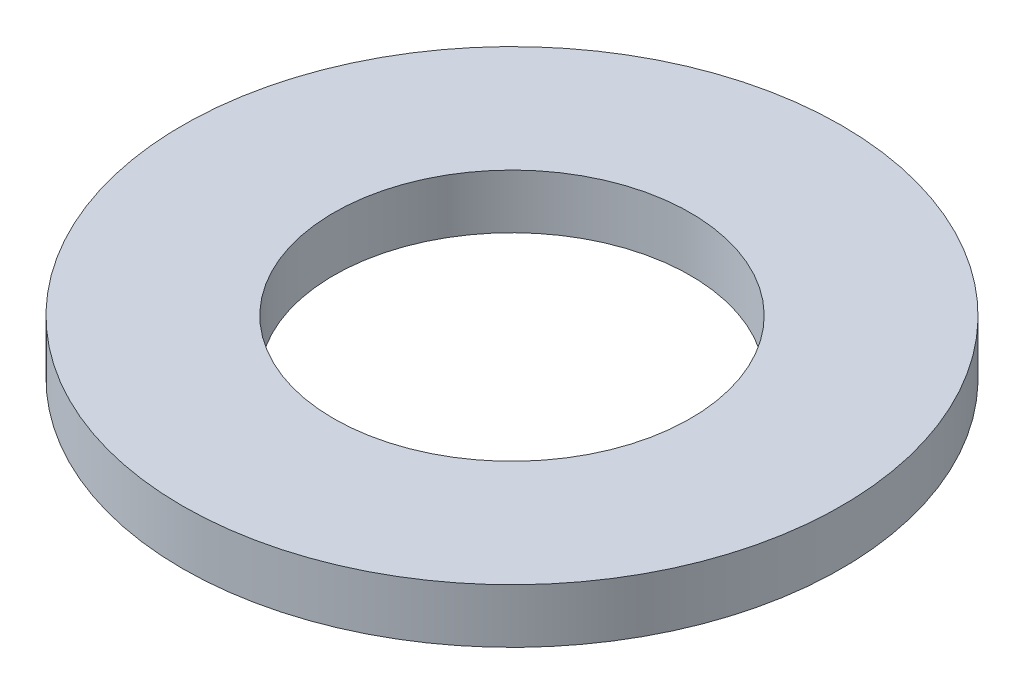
ISO-10303-21;
HEADER;
FILE_DESCRIPTION(('STEP AP214'),'2;1');
FILE_NAME('part.step','',(''),(''),'','','');
FILE_SCHEMA(('AUTOMOTIVE_DESIGN { 1 0 10303 214 1 1 1 1 }'));
ENDSEC;
DATA;
#1=APPLICATION_CONTEXT('core data for automotive mechanical design processes');
#2=APPLICATION_PROTOCOL_DEFINITION('international standard','automotive_design',2000,#1);
#3=PRODUCT_CONTEXT('',#1,'mechanical');
#4=PRODUCT('Part','Part','',(#3));
#5=PRODUCT_RELATED_PRODUCT_CATEGORY('part','',(#4));
#6=PRODUCT_DEFINITION_FORMATION('','',#4);
#7=PRODUCT_DEFINITION_CONTEXT('part definition',#1,'design');
#8=PRODUCT_DEFINITION('design','',#6,#7);
#9=PRODUCT_DEFINITION_SHAPE('','',#8);
#10=(LENGTH_UNIT() NAMED_UNIT(*) SI_UNIT(.MILLI.,.METRE.));
#11=(NAMED_UNIT(*) PLANE_ANGLE_UNIT() SI_UNIT($,.RADIAN.));
#12=(NAMED_UNIT(*) SI_UNIT($,.STERADIAN.) SOLID_ANGLE_UNIT());
#13=UNCERTAINTY_MEASURE_WITH_UNIT(LENGTH_MEASURE(1.E-05),#10,'distance_accuracy_value','');
#14=(GEOMETRIC_REPRESENTATION_CONTEXT(3) GLOBAL_UNCERTAINTY_ASSIGNED_CONTEXT((#13)) GLOBAL_UNIT_ASSIGNED_CONTEXT((#10,
#11,#12)) REPRESENTATION_CONTEXT('',''));
#15=CARTESIAN_POINT('',(0.,0.,0.));
#16=DIRECTION('',(0.,0.,1.));
#17=DIRECTION('',(1.,0.,0.));
#18=AXIS2_PLACEMENT_3D('',#15,#16,#17);
#19=CARTESIAN_POINT('',(0.,7.,0.));
#20=DIRECTION('',(0.,1.,0.));
#21=DIRECTION('',(0.,0.,1.));
#22=AXIS2_PLACEMENT_3D('',#19,#20,#21);
#23=PLANE('',#22);
#24=CARTESIAN_POINT('',(0.,7.,0.));
#25=DIRECTION('',(0.,1.,0.));
#26=DIRECTION('',(0.,0.,1.));
#27=AXIS2_PLACEMENT_3D('',#24,#25,#26);
#28=CIRCLE('',#27,42.5);
#29=CARTESIAN_POINT('',(0.,7.,42.5));
#30=VERTEX_POINT('',#29);
#31=EDGE_CURVE('E10',#30,#30,#28,.T.);
#32=ORIENTED_EDGE('',*,*,#31,.T.);
#33=EDGE_LOOP('',(#32));
#34=FACE_BOUND('',#33,.T.);
#35=CARTESIAN_POINT('',(0.,7.,0.));
#36=DIRECTION('',(0.,1.,0.));
#37=DIRECTION('',(0.,0.,1.));
#38=AXIS2_PLACEMENT_3D('',#35,#36,#37);
#39=CIRCLE('',#38,23.);
#40=CARTESIAN_POINT('',(0.,7.,23.));
#41=VERTEX_POINT('',#40);
#42=EDGE_CURVE('E39',#41,#41,#39,.T.);
#43=ORIENTED_EDGE('',*,*,#42,.F.);
#44=EDGE_LOOP('',(#43));
#45=FACE_BOUND('',#44,.T.);
#46=ADVANCED_FACE('F28',(#34,#45),#23,.T.);
#47=CARTESIAN_POINT('',(0.,0.,0.));
#48=DIRECTION('',(0.,1.,0.));
#49=DIRECTION('',(0.,0.,1.));
#50=AXIS2_PLACEMENT_3D('',#47,#48,#49);
#51=PLANE('',#50);
#52=CARTESIAN_POINT('',(0.,0.,0.));
#53=DIRECTION('',(0.,1.,0.));
#54=DIRECTION('',(0.,0.,1.));
#55=AXIS2_PLACEMENT_3D('',#52,#53,#54);
#56=CIRCLE('',#55,42.5);
#57=CARTESIAN_POINT('',(0.,0.,42.5));
#58=VERTEX_POINT('',#57);
#59=EDGE_CURVE('E35',#58,#58,#56,.T.);
#60=ORIENTED_EDGE('',*,*,#59,.F.);
#61=EDGE_LOOP('',(#60));
#62=FACE_BOUND('',#61,.T.);
#63=CARTESIAN_POINT('',(0.,0.,0.));
#64=DIRECTION('',(0.,1.,0.));
#65=DIRECTION('',(0.,0.,1.));
#66=AXIS2_PLACEMENT_3D('',#63,#64,#65);
#67=CIRCLE('',#66,23.);
#68=CARTESIAN_POINT('',(0.,0.,23.));
#69=VERTEX_POINT('',#68);
#70=EDGE_CURVE('E43',#69,#69,#67,.T.);
#71=ORIENTED_EDGE('',*,*,#70,.T.);
#72=EDGE_LOOP('',(#71));
#73=FACE_BOUND('',#72,.T.);
#74=ADVANCED_FACE('F49',(#62,#73),#51,.F.);
#75=CARTESIAN_POINT('',(0.,7.,0.));
#76=DIRECTION('',(0.,-1.,0.));
#77=DIRECTION('',(0.,0.,-1.));
#78=AXIS2_PLACEMENT_3D('',#75,#76,#77);
#79=CYLINDRICAL_SURFACE('',#78,42.5);
#80=ORIENTED_EDGE('',*,*,#31,.F.);
#81=EDGE_LOOP('',(#80));
#82=FACE_BOUND('',#81,.T.);
#83=ORIENTED_EDGE('',*,*,#59,.T.);
#84=EDGE_LOOP('',(#83));
#85=FACE_BOUND('',#84,.T.);
#86=ADVANCED_FACE('F30',(#82,#85),#79,.T.);
#87=CARTESIAN_POINT('',(0.,7.,0.));
#88=DIRECTION('',(0.,-1.,0.));
#89=DIRECTION('',(0.,0.,-1.));
#90=AXIS2_PLACEMENT_3D('',#87,#88,#89);
#91=CYLINDRICAL_SURFACE('',#90,23.);
#92=ORIENTED_EDGE('',*,*,#42,.T.);
#93=EDGE_LOOP('',(#92));
#94=FACE_BOUND('',#93,.T.);
#95=ORIENTED_EDGE('',*,*,#70,.F.);
#96=EDGE_LOOP('',(#95));
#97=FACE_BOUND('',#96,.T.);
#98=ADVANCED_FACE('F51',(#94,#97),#91,.F.);
#99=CLOSED_SHELL('',(#46,#74,#86,#98));
#100=MANIFOLD_SOLID_BREP('B2',#99);
#101=ADVANCED_BREP_SHAPE_REPRESENTATION('',(#18,#100),#14);
#102=SHAPE_DEFINITION_REPRESENTATION(#9,#101);
ENDSEC;
END-ISO-10303-21;
